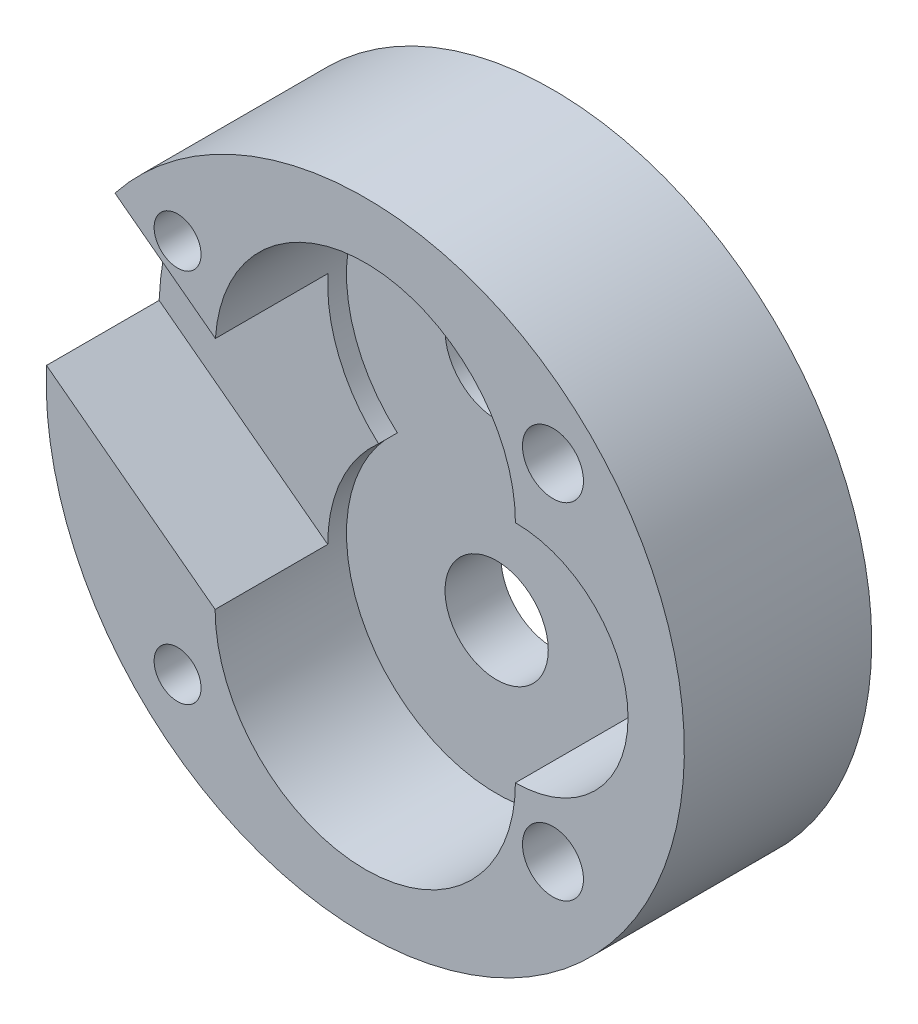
from build123d import *

# Parameters (mm, degrees)
SKETCH1_R          = 53.975
BASE_EXTRUDE_DEPTH = 31.6992
CUT_EXTRUDE1_DEPTH = 22.225
SKETCH3_R          = 19.05
CUT_EXTRUDE3_DEPTH = 19.05
CUT_EXTRUDE4_DEPTH = 19.05
SKETCH5_R          = 8.73125
CUT_EXTRUDE5_DEPTH = 22.225
SKETCH6_R          = 5.159375
CUT_EXTRUDE6_DEPTH = 83.652528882
SKETCH7_R          = 3.96875
CUT_EXTRUDE7_DEPTH = 83.652528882


with BuildPart() as part:
    # Sketch1 → Base-Extrude (new body)
    with BuildSketch(Plane.XY):
        Circle(SKETCH1_R)
    extrude(amount=BASE_EXTRUDE_DEPTH)

    # Sketch2 → Cut-Extrude1 (cut)
    with BuildSketch(Plane.XY.offset(31.6992)):
        with BuildLine():
            ThreePointArc((-16.800520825, 0), (0, 44.45), (16.800520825, 0))
            ThreePointArc((16.800520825, 0), (0, -44.45), (-16.800520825, 0))
        make_face()
    extrude(amount=-CUT_EXTRUDE1_DEPTH, mode=Mode.SUBTRACT)

    # Sketch3 → Cut-Extrude3 (cut)
    with BuildSketch(Plane.XY.offset(31.6992)):
        with Locations((25.4, 0)):
            Circle(SKETCH3_R)
    extrude(amount=-CUT_EXTRUDE3_DEPTH, mode=Mode.SUBTRACT)

    # Sketch4 → Cut-Extrude4 (cut)
    with BuildSketch(Plane.XY.offset(31.6992)):
        with BuildLine():
            Line((-42.342588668, 33.472463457), (-25.348509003, 20.666505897))
            ThreePointArc((-25.348509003, 20.666505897), (-23.47149964, 9.341822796), (-16.800520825, 0))
            ThreePointArc((-16.800520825, 0), (-23.150520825, -8.599479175), (-25.4, -19.05))
            Line((-25.4, -19.05), (-53.919766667, 2.44118568))
            ThreePointArc((-53.919766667, 2.44118568), (-50.570201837, 18.866777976), (-42.342588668, 33.472463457))
        make_face()
    extrude(amount=-CUT_EXTRUDE4_DEPTH, mode=Mode.SUBTRACT)

    # Sketch5 → Cut-Extrude5 (cut)
    with BuildSketch(Plane.XY.offset(9.4742)):
        with Locations((0, -19.05)):
            Circle(SKETCH5_R)
        with Locations((0, 19.05)):
            Circle(SKETCH5_R)
    extrude(amount=-CUT_EXTRUDE5_DEPTH, mode=Mode.SUBTRACT)

    # Sketch6 → Cut-Extrude6 (cut, through all)
    with BuildSketch(Plane.XY.offset(31.6992)):
        with Locations((31.75, 30.913822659)):
            Circle(SKETCH6_R)
        with Locations((31.75, -27.430575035)):
            Circle(SKETCH6_R)
    extrude(amount=-CUT_EXTRUDE6_DEPTH, mode=Mode.SUBTRACT)

    # Sketch7 → Cut-Extrude7 (cut, through all)
    with BuildSketch(Plane.XY.offset(31.6992)):
        with Locations((-31.75, 31.75)):
            Circle(SKETCH7_R)
        with Locations((-31.75, -31.75)):
            Circle(SKETCH7_R)
    extrude(amount=-CUT_EXTRUDE7_DEPTH, mode=Mode.SUBTRACT)


solid = part.part
